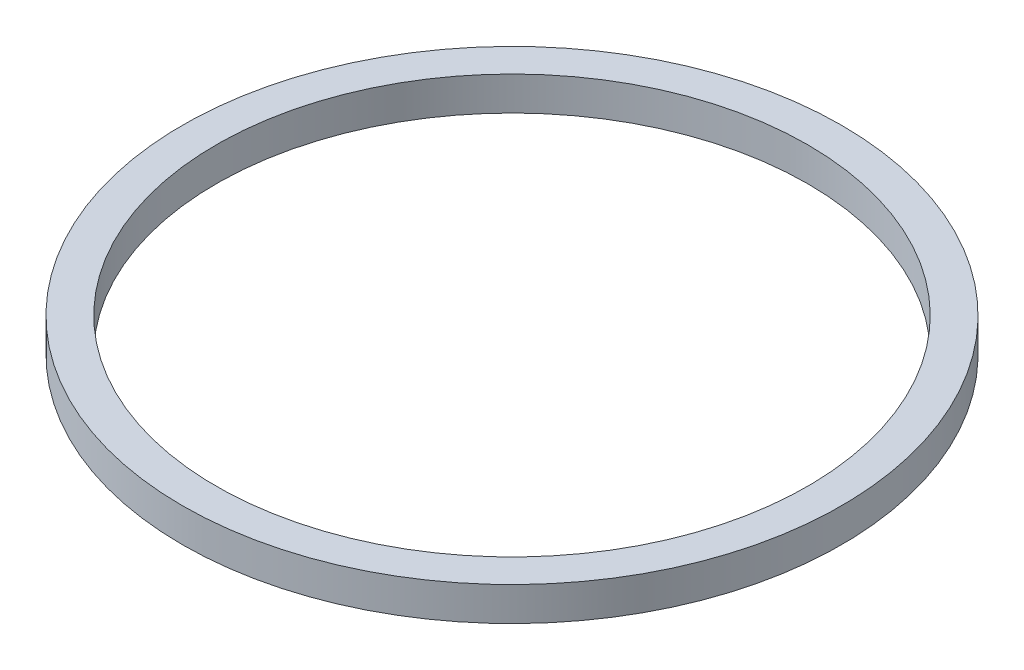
from build123d import *

# Parameters (mm, degrees)
SKETCH1_W = 8
SKETCH1_H = 8


with BuildPart() as part:
    # Sketch1 → Revolve1 (revolve)
    with BuildSketch(Plane.XY, mode=Mode.PRIVATE) as revolve1_sk:
        with Locations((74, 4)):
            Rectangle(SKETCH1_W, SKETCH1_H)
    revolve(revolve1_sk.sketch.rotate(Axis((0, 0, 0), (0, 1, 0)), 90), axis=Axis((0, 0, 0), (0, 1, 0)))


solid = part.part
